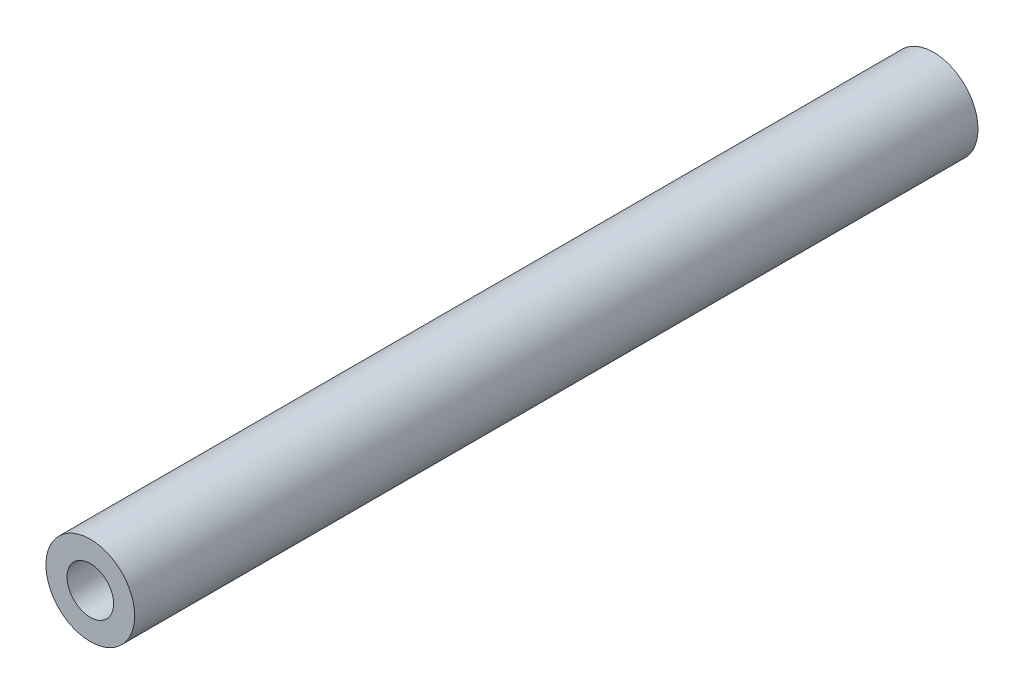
ISO-10303-21;
HEADER;
FILE_DESCRIPTION(('STEP AP214'),'2;1');
FILE_NAME('part.step','',(''),(''),'','','');
FILE_SCHEMA(('AUTOMOTIVE_DESIGN { 1 0 10303 214 1 1 1 1 }'));
ENDSEC;
DATA;
#1=APPLICATION_CONTEXT('core data for automotive mechanical design processes');
#2=APPLICATION_PROTOCOL_DEFINITION('international standard','automotive_design',2000,#1);
#3=PRODUCT_CONTEXT('',#1,'mechanical');
#4=PRODUCT('Part','Part','',(#3));
#5=PRODUCT_RELATED_PRODUCT_CATEGORY('part','',(#4));
#6=PRODUCT_DEFINITION_FORMATION('','',#4);
#7=PRODUCT_DEFINITION_CONTEXT('part definition',#1,'design');
#8=PRODUCT_DEFINITION('design','',#6,#7);
#9=PRODUCT_DEFINITION_SHAPE('','',#8);
#10=(LENGTH_UNIT() NAMED_UNIT(*) SI_UNIT(.MILLI.,.METRE.));
#11=(NAMED_UNIT(*) PLANE_ANGLE_UNIT() SI_UNIT($,.RADIAN.));
#12=(NAMED_UNIT(*) SI_UNIT($,.STERADIAN.) SOLID_ANGLE_UNIT());
#13=UNCERTAINTY_MEASURE_WITH_UNIT(LENGTH_MEASURE(1.E-05),#10,'distance_accuracy_value','');
#14=(GEOMETRIC_REPRESENTATION_CONTEXT(3) GLOBAL_UNCERTAINTY_ASSIGNED_CONTEXT((#13)) GLOBAL_UNIT_ASSIGNED_CONTEXT((#10,
#11,#12)) REPRESENTATION_CONTEXT('',''));
#15=CARTESIAN_POINT('',(0.,0.,0.));
#16=DIRECTION('',(0.,0.,1.));
#17=DIRECTION('',(1.,0.,0.));
#18=AXIS2_PLACEMENT_3D('',#15,#16,#17);
#19=CARTESIAN_POINT('',(0.,0.,38.));
#20=DIRECTION('',(0.,0.,-1.));
#21=DIRECTION('',(-1.,0.,0.));
#22=AXIS2_PLACEMENT_3D('',#19,#20,#21);
#23=CYLINDRICAL_SURFACE('',#22,4.);
#24=CARTESIAN_POINT('',(0.,0.,38.));
#25=DIRECTION('',(0.,0.,1.));
#26=DIRECTION('',(1.,0.,0.));
#27=AXIS2_PLACEMENT_3D('',#24,#25,#26);
#28=CIRCLE('',#27,4.);
#29=CARTESIAN_POINT('',(4.,0.,38.));
#30=VERTEX_POINT('',#29);
#31=EDGE_CURVE('E11',#30,#30,#28,.T.);
#32=ORIENTED_EDGE('',*,*,#31,.F.);
#33=EDGE_LOOP('',(#32));
#34=FACE_BOUND('',#33,.T.);
#35=CARTESIAN_POINT('',(0.,0.,-38.));
#36=DIRECTION('',(0.,0.,1.));
#37=DIRECTION('',(1.,0.,0.));
#38=AXIS2_PLACEMENT_3D('',#35,#36,#37);
#39=CIRCLE('',#38,4.);
#40=CARTESIAN_POINT('',(4.,0.,-38.));
#41=VERTEX_POINT('',#40);
#42=EDGE_CURVE('E59',#41,#41,#39,.T.);
#43=ORIENTED_EDGE('',*,*,#42,.T.);
#44=EDGE_LOOP('',(#43));
#45=FACE_BOUND('',#44,.T.);
#46=ADVANCED_FACE('F34',(#34,#45),#23,.T.);
#47=CARTESIAN_POINT('',(0.,0.,38.));
#48=DIRECTION('',(0.,0.,1.));
#49=DIRECTION('',(1.,0.,0.));
#50=AXIS2_PLACEMENT_3D('',#47,#48,#49);
#51=PLANE('',#50);
#52=CARTESIAN_POINT('',(0.,0.,38.));
#53=DIRECTION('',(0.,0.,1.));
#54=DIRECTION('',(1.,0.,0.));
#55=AXIS2_PLACEMENT_3D('',#52,#53,#54);
#56=CIRCLE('',#55,2.1);
#57=CARTESIAN_POINT('',(2.1,0.,38.));
#58=VERTEX_POINT('',#57);
#59=EDGE_CURVE('E41',#58,#58,#56,.T.);
#60=ORIENTED_EDGE('',*,*,#59,.F.);
#61=EDGE_LOOP('',(#60));
#62=FACE_BOUND('',#61,.T.);
#63=ORIENTED_EDGE('',*,*,#31,.T.);
#64=EDGE_LOOP('',(#63));
#65=FACE_BOUND('',#64,.T.);
#66=ADVANCED_FACE('F71',(#62,#65),#51,.T.);
#67=CARTESIAN_POINT('',(0.,0.,38.));
#68=DIRECTION('',(0.,0.,1.));
#69=DIRECTION('',(1.,0.,0.));
#70=AXIS2_PLACEMENT_3D('',#67,#68,#69);
#71=CYLINDRICAL_SURFACE('',#70,2.1);
#72=CARTESIAN_POINT('',(0.,0.,23.6));
#73=DIRECTION('',(0.,0.,1.));
#74=DIRECTION('',(1.,0.,0.));
#75=AXIS2_PLACEMENT_3D('',#72,#73,#74);
#76=CIRCLE('',#75,2.1);
#77=CARTESIAN_POINT('',(2.1,0.,23.6));
#78=VERTEX_POINT('',#77);
#79=EDGE_CURVE('E64',#78,#78,#76,.T.);
#80=ORIENTED_EDGE('',*,*,#79,.F.);
#81=EDGE_LOOP('',(#80));
#82=FACE_BOUND('',#81,.T.);
#83=ORIENTED_EDGE('',*,*,#59,.T.);
#84=EDGE_LOOP('',(#83));
#85=FACE_BOUND('',#84,.T.);
#86=ADVANCED_FACE('F69',(#82,#85),#71,.F.);
#87=CARTESIAN_POINT('',(0.,0.,23.6));
#88=DIRECTION('',(0.,0.,1.));
#89=DIRECTION('',(1.,0.,0.));
#90=AXIS2_PLACEMENT_3D('',#87,#88,#89);
#91=CONICAL_SURFACE('',#90,2.1,1.02974425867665);
#92=CARTESIAN_POINT('',(0.,0.,22.3381927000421));
#93=VERTEX_POINT('',#92);
#94=VERTEX_LOOP('',#93);
#95=FACE_BOUND('',#94,.T.);
#96=ORIENTED_EDGE('',*,*,#79,.T.);
#97=EDGE_LOOP('',(#96));
#98=FACE_BOUND('',#97,.T.);
#99=ADVANCED_FACE('F82',(#95,#98),#91,.F.);
#100=CARTESIAN_POINT('',(0.,0.,-38.));
#101=DIRECTION('',(0.,0.,-1.));
#102=DIRECTION('',(1.,0.,0.));
#103=AXIS2_PLACEMENT_3D('',#100,#101,#102);
#104=PLANE('',#103);
#105=CARTESIAN_POINT('',(0.,0.,-38.));
#106=DIRECTION('',(0.,0.,1.));
#107=DIRECTION('',(1.,0.,0.));
#108=AXIS2_PLACEMENT_3D('',#105,#106,#107);
#109=CIRCLE('',#108,2.1);
#110=CARTESIAN_POINT('',(2.1,0.,-38.));
#111=VERTEX_POINT('',#110);
#112=EDGE_CURVE('E56',#111,#111,#109,.T.);
#113=ORIENTED_EDGE('',*,*,#112,.T.);
#114=EDGE_LOOP('',(#113));
#115=FACE_BOUND('',#114,.T.);
#116=ORIENTED_EDGE('',*,*,#42,.F.);
#117=EDGE_LOOP('',(#116));
#118=FACE_BOUND('',#117,.T.);
#119=ADVANCED_FACE('F80',(#115,#118),#104,.T.);
#120=CARTESIAN_POINT('',(0.,0.,-38.));
#121=DIRECTION('',(0.,0.,-1.));
#122=DIRECTION('',(1.,0.,0.));
#123=AXIS2_PLACEMENT_3D('',#120,#121,#122);
#124=CYLINDRICAL_SURFACE('',#123,2.1);
#125=CARTESIAN_POINT('',(0.,0.,-23.6));
#126=DIRECTION('',(0.,0.,1.));
#127=DIRECTION('',(1.,0.,0.));
#128=AXIS2_PLACEMENT_3D('',#125,#126,#127);
#129=CIRCLE('',#128,2.1);
#130=CARTESIAN_POINT('',(2.1,0.,-23.6));
#131=VERTEX_POINT('',#130);
#132=EDGE_CURVE('E54',#131,#131,#129,.T.);
#133=ORIENTED_EDGE('',*,*,#132,.T.);
#134=EDGE_LOOP('',(#133));
#135=FACE_BOUND('',#134,.T.);
#136=ORIENTED_EDGE('',*,*,#112,.F.);
#137=EDGE_LOOP('',(#136));
#138=FACE_BOUND('',#137,.T.);
#139=ADVANCED_FACE('F50',(#135,#138),#124,.F.);
#140=CARTESIAN_POINT('',(0.,0.,-23.6));
#141=DIRECTION('',(0.,0.,-1.));
#142=DIRECTION('',(1.,0.,0.));
#143=AXIS2_PLACEMENT_3D('',#140,#141,#142);
#144=CONICAL_SURFACE('',#143,2.1,1.02974425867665);
#145=CARTESIAN_POINT('',(0.,0.,-22.3381927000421));
#146=VERTEX_POINT('',#145);
#147=VERTEX_LOOP('',#146);
#148=FACE_BOUND('',#147,.T.);
#149=ORIENTED_EDGE('',*,*,#132,.F.);
#150=EDGE_LOOP('',(#149));
#151=FACE_BOUND('',#150,.T.);
#152=ADVANCED_FACE('F47',(#148,#151),#144,.F.);
#153=CLOSED_SHELL('',(#46,#66,#86,#99,#119,#139,#152));
#154=MANIFOLD_SOLID_BREP('B2',#153);
#155=ADVANCED_BREP_SHAPE_REPRESENTATION('',(#18,#154),#14);
#156=SHAPE_DEFINITION_REPRESENTATION(#9,#155);
ENDSEC;
END-ISO-10303-21;
